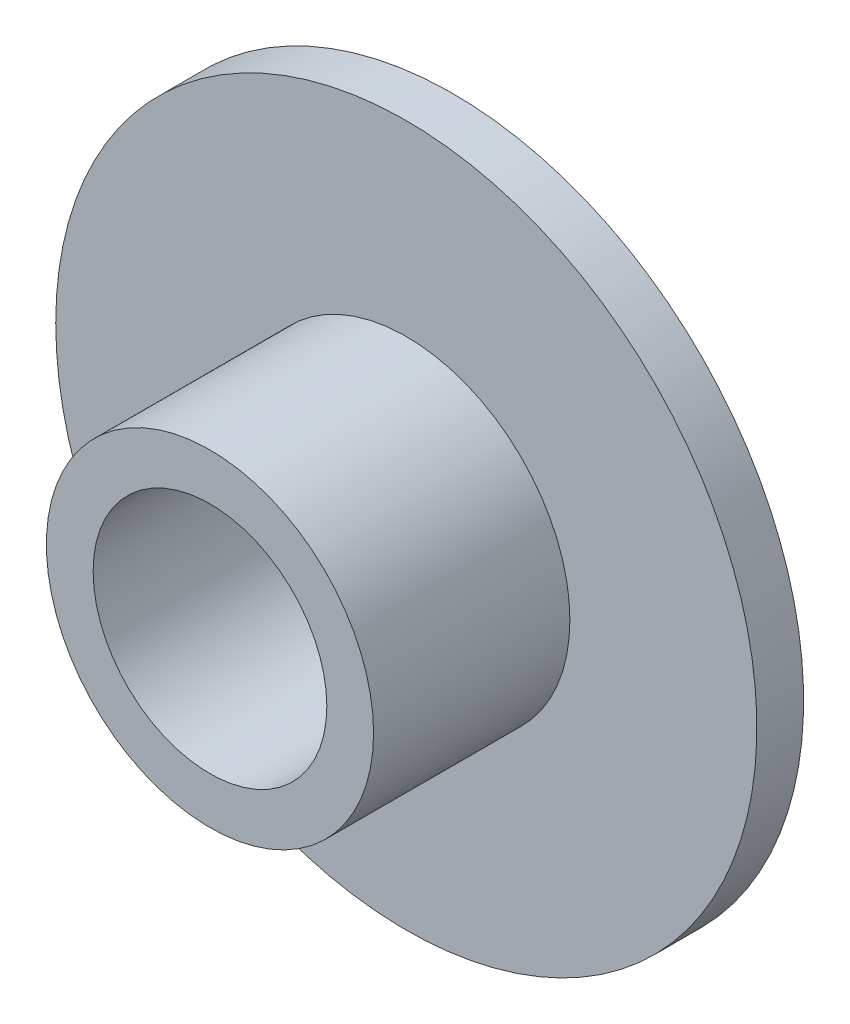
ISO-10303-21;
HEADER;
FILE_DESCRIPTION(('STEP AP214'),'2;1');
FILE_NAME('part.step','',(''),(''),'','','');
FILE_SCHEMA(('AUTOMOTIVE_DESIGN { 1 0 10303 214 1 1 1 1 }'));
ENDSEC;
DATA;
#1=APPLICATION_CONTEXT('core data for automotive mechanical design processes');
#2=APPLICATION_PROTOCOL_DEFINITION('international standard','automotive_design',2000,#1);
#3=PRODUCT_CONTEXT('',#1,'mechanical');
#4=PRODUCT('Part','Part','',(#3));
#5=PRODUCT_RELATED_PRODUCT_CATEGORY('part','',(#4));
#6=PRODUCT_DEFINITION_FORMATION('','',#4);
#7=PRODUCT_DEFINITION_CONTEXT('part definition',#1,'design');
#8=PRODUCT_DEFINITION('design','',#6,#7);
#9=PRODUCT_DEFINITION_SHAPE('','',#8);
#10=(LENGTH_UNIT() NAMED_UNIT(*) SI_UNIT(.MILLI.,.METRE.));
#11=(NAMED_UNIT(*) PLANE_ANGLE_UNIT() SI_UNIT($,.RADIAN.));
#12=(NAMED_UNIT(*) SI_UNIT($,.STERADIAN.) SOLID_ANGLE_UNIT());
#13=UNCERTAINTY_MEASURE_WITH_UNIT(LENGTH_MEASURE(1.E-05),#10,'distance_accuracy_value','');
#14=(GEOMETRIC_REPRESENTATION_CONTEXT(3) GLOBAL_UNCERTAINTY_ASSIGNED_CONTEXT((#13)) GLOBAL_UNIT_ASSIGNED_CONTEXT((#10,
#11,#12)) REPRESENTATION_CONTEXT('',''));
#15=CARTESIAN_POINT('',(0.,0.,0.));
#16=DIRECTION('',(0.,0.,1.));
#17=DIRECTION('',(1.,0.,0.));
#18=AXIS2_PLACEMENT_3D('',#15,#16,#17);
#19=CARTESIAN_POINT('',(0.,0.,4.19999999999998));
#20=DIRECTION('',(0.,0.,1.));
#21=DIRECTION('',(1.,0.,0.));
#22=AXIS2_PLACEMENT_3D('',#19,#20,#21);
#23=PLANE('',#22);
#24=CARTESIAN_POINT('',(0.,0.,4.19999999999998));
#25=DIRECTION('',(0.,0.,1.));
#26=DIRECTION('',(1.,0.,0.));
#27=AXIS2_PLACEMENT_3D('',#24,#25,#26);
#28=CIRCLE('',#27,3.5);
#29=CARTESIAN_POINT('',(3.5,0.,4.19999999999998));
#30=VERTEX_POINT('',#29);
#31=EDGE_CURVE('E12',#30,#30,#28,.T.);
#32=ORIENTED_EDGE('',*,*,#31,.T.);
#33=EDGE_LOOP('',(#32));
#34=FACE_BOUND('',#33,.T.);
#35=CARTESIAN_POINT('',(0.,0.,4.19999999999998));
#36=DIRECTION('',(0.,0.,1.));
#37=DIRECTION('',(1.,0.,0.));
#38=AXIS2_PLACEMENT_3D('',#35,#36,#37);
#39=CIRCLE('',#38,2.5);
#40=CARTESIAN_POINT('',(2.5,0.,4.19999999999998));
#41=VERTEX_POINT('',#40);
#42=EDGE_CURVE('E67',#41,#41,#39,.T.);
#43=ORIENTED_EDGE('',*,*,#42,.F.);
#44=EDGE_LOOP('',(#43));
#45=FACE_BOUND('',#44,.T.);
#46=ADVANCED_FACE('F58',(#34,#45),#23,.T.);
#47=CARTESIAN_POINT('',(0.,0.,4.19999999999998));
#48=DIRECTION('',(0.,0.,-1.));
#49=DIRECTION('',(-1.,0.,0.));
#50=AXIS2_PLACEMENT_3D('',#47,#48,#49);
#51=CYLINDRICAL_SURFACE('',#50,3.5);
#52=ORIENTED_EDGE('',*,*,#31,.F.);
#53=EDGE_LOOP('',(#52));
#54=FACE_BOUND('',#53,.T.);
#55=CARTESIAN_POINT('',(0.,0.,0.));
#56=DIRECTION('',(0.,0.,1.));
#57=DIRECTION('',(1.,0.,0.));
#58=AXIS2_PLACEMENT_3D('',#55,#56,#57);
#59=CIRCLE('',#58,3.5);
#60=CARTESIAN_POINT('',(3.5,0.,0.));
#61=VERTEX_POINT('',#60);
#62=EDGE_CURVE('E62',#61,#61,#59,.T.);
#63=ORIENTED_EDGE('',*,*,#62,.T.);
#64=EDGE_LOOP('',(#63));
#65=FACE_BOUND('',#64,.T.);
#66=ADVANCED_FACE('F60',(#54,#65),#51,.T.);
#67=CARTESIAN_POINT('',(0.,0.,4.19999999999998));
#68=DIRECTION('',(0.,0.,-1.));
#69=DIRECTION('',(-1.,0.,0.));
#70=AXIS2_PLACEMENT_3D('',#67,#68,#69);
#71=CYLINDRICAL_SURFACE('',#70,2.5);
#72=ORIENTED_EDGE('',*,*,#42,.T.);
#73=EDGE_LOOP('',(#72));
#74=FACE_BOUND('',#73,.T.);
#75=CARTESIAN_POINT('',(0.,0.,-1.));
#76=DIRECTION('',(0.,0.,-1.));
#77=DIRECTION('',(-1.,0.,0.));
#78=AXIS2_PLACEMENT_3D('',#75,#76,#77);
#79=CIRCLE('',#78,2.5);
#80=CARTESIAN_POINT('',(-2.5,0.,-1.));
#81=VERTEX_POINT('',#80);
#82=EDGE_CURVE('E82',#81,#81,#79,.T.);
#83=ORIENTED_EDGE('',*,*,#82,.T.);
#84=EDGE_LOOP('',(#83));
#85=FACE_BOUND('',#84,.T.);
#86=ADVANCED_FACE('F90',(#74,#85),#71,.F.);
#87=CARTESIAN_POINT('',(0.,0.,-1.));
#88=DIRECTION('',(0.,0.,-1.));
#89=DIRECTION('',(-1.,0.,0.));
#90=AXIS2_PLACEMENT_3D('',#87,#88,#89);
#91=PLANE('',#90);
#92=CARTESIAN_POINT('',(0.,0.,-1.));
#93=DIRECTION('',(0.,0.,-1.));
#94=DIRECTION('',(-1.,0.,0.));
#95=AXIS2_PLACEMENT_3D('',#92,#93,#94);
#96=CIRCLE('',#95,7.5);
#97=CARTESIAN_POINT('',(-7.5,0.,-1.));
#98=VERTEX_POINT('',#97);
#99=EDGE_CURVE('E81',#98,#98,#96,.T.);
#100=ORIENTED_EDGE('',*,*,#99,.T.);
#101=EDGE_LOOP('',(#100));
#102=FACE_BOUND('',#101,.T.);
#103=ORIENTED_EDGE('',*,*,#82,.F.);
#104=EDGE_LOOP('',(#103));
#105=FACE_BOUND('',#104,.T.);
#106=ADVANCED_FACE('F92',(#102,#105),#91,.T.);
#107=CARTESIAN_POINT('',(0.,0.,0.));
#108=DIRECTION('',(0.,0.,-1.));
#109=DIRECTION('',(-1.,0.,0.));
#110=AXIS2_PLACEMENT_3D('',#107,#108,#109);
#111=PLANE('',#110);
#112=ORIENTED_EDGE('',*,*,#62,.F.);
#113=EDGE_LOOP('',(#112));
#114=FACE_BOUND('',#113,.T.);
#115=CARTESIAN_POINT('',(0.,0.,0.));
#116=DIRECTION('',(0.,0.,-1.));
#117=DIRECTION('',(-1.,0.,0.));
#118=AXIS2_PLACEMENT_3D('',#115,#116,#117);
#119=CIRCLE('',#118,7.5);
#120=CARTESIAN_POINT('',(-7.5,0.,0.));
#121=VERTEX_POINT('',#120);
#122=EDGE_CURVE('E77',#121,#121,#119,.T.);
#123=ORIENTED_EDGE('',*,*,#122,.F.);
#124=EDGE_LOOP('',(#123));
#125=FACE_BOUND('',#124,.T.);
#126=ADVANCED_FACE('F94',(#114,#125),#111,.F.);
#127=CARTESIAN_POINT('',(0.,0.,-1.));
#128=DIRECTION('',(0.,0.,1.));
#129=DIRECTION('',(1.,0.,0.));
#130=AXIS2_PLACEMENT_3D('',#127,#128,#129);
#131=CYLINDRICAL_SURFACE('',#130,7.5);
#132=ORIENTED_EDGE('',*,*,#99,.F.);
#133=EDGE_LOOP('',(#132));
#134=FACE_BOUND('',#133,.T.);
#135=ORIENTED_EDGE('',*,*,#122,.T.);
#136=EDGE_LOOP('',(#135));
#137=FACE_BOUND('',#136,.T.);
#138=ADVANCED_FACE('F101',(#134,#137),#131,.T.);
#139=CLOSED_SHELL('',(#46,#66,#86,#106,#126,#138));
#140=MANIFOLD_SOLID_BREP('B2',#139);
#141=ADVANCED_BREP_SHAPE_REPRESENTATION('',(#18,#140),#14);
#142=SHAPE_DEFINITION_REPRESENTATION(#9,#141);
ENDSEC;
END-ISO-10303-21;
